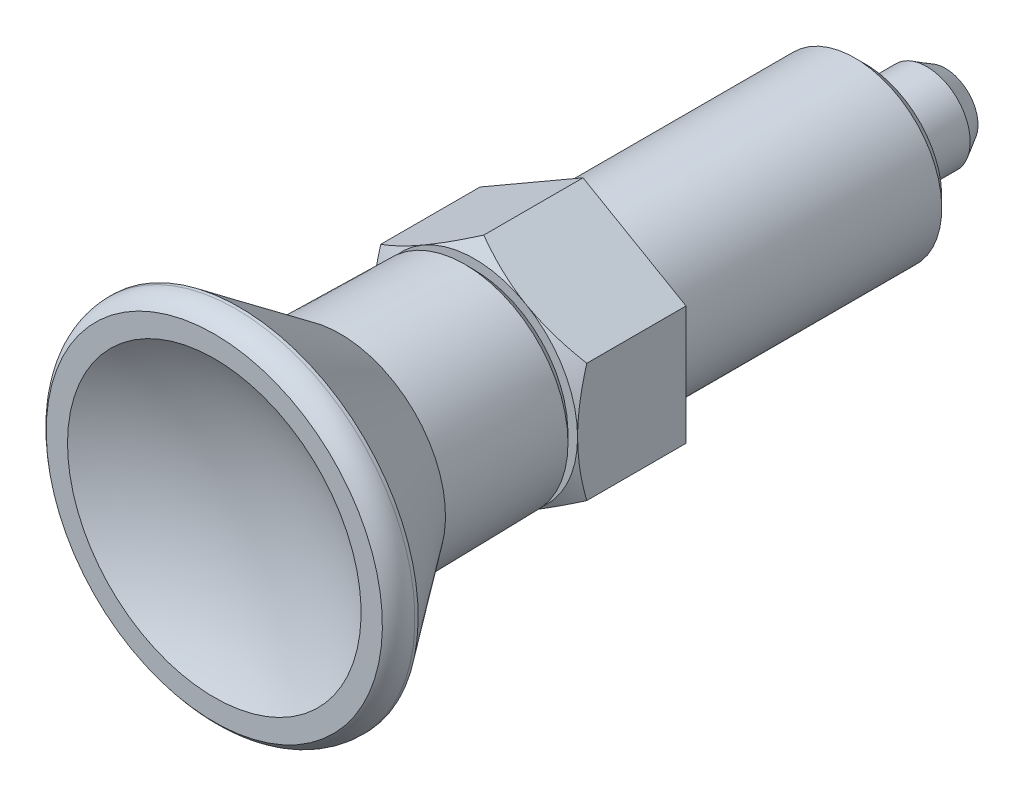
ISO-10303-21;
HEADER;
FILE_DESCRIPTION(('STEP AP214'),'2;1');
FILE_NAME('part.step','',(''),(''),'','','');
FILE_SCHEMA(('AUTOMOTIVE_DESIGN { 1 0 10303 214 1 1 1 1 }'));
ENDSEC;
DATA;
#1=APPLICATION_CONTEXT('core data for automotive mechanical design processes');
#2=APPLICATION_PROTOCOL_DEFINITION('international standard','automotive_design',2000,#1);
#3=PRODUCT_CONTEXT('',#1,'mechanical');
#4=PRODUCT('Part','Part','',(#3));
#5=PRODUCT_RELATED_PRODUCT_CATEGORY('part','',(#4));
#6=PRODUCT_DEFINITION_FORMATION('','',#4);
#7=PRODUCT_DEFINITION_CONTEXT('part definition',#1,'design');
#8=PRODUCT_DEFINITION('design','',#6,#7);
#9=PRODUCT_DEFINITION_SHAPE('','',#8);
#10=(LENGTH_UNIT() NAMED_UNIT(*) SI_UNIT(.MILLI.,.METRE.));
#11=(NAMED_UNIT(*) PLANE_ANGLE_UNIT() SI_UNIT($,.RADIAN.));
#12=(NAMED_UNIT(*) SI_UNIT($,.STERADIAN.) SOLID_ANGLE_UNIT());
#13=UNCERTAINTY_MEASURE_WITH_UNIT(LENGTH_MEASURE(1.E-05),#10,'distance_accuracy_value','');
#14=(GEOMETRIC_REPRESENTATION_CONTEXT(3) GLOBAL_UNCERTAINTY_ASSIGNED_CONTEXT((#13)) GLOBAL_UNIT_ASSIGNED_CONTEXT((#10,
#11,#12)) REPRESENTATION_CONTEXT('',''));
#15=CARTESIAN_POINT('',(0.,0.,0.));
#16=DIRECTION('',(0.,0.,1.));
#17=DIRECTION('',(1.,0.,0.));
#18=AXIS2_PLACEMENT_3D('',#15,#16,#17);
#19=CARTESIAN_POINT('',(0.,0.,-26.));
#20=DIRECTION('',(-1.,0.,0.));
#21=DIRECTION('',(0.,1.,0.));
#22=AXIS2_PLACEMENT_3D('',#19,#20,#21);
#23=SPHERICAL_SURFACE('',#22,8.00000000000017);
#24=CARTESIAN_POINT('',(0.,0.,-33.4113534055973));
#25=DIRECTION('',(0.,0.,1.));
#26=DIRECTION('',(0.,-1.,0.));
#27=AXIS2_PLACEMENT_3D('',#24,#25,#26);
#28=CIRCLE('',#27,3.0119496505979);
#29=CARTESIAN_POINT('',(0.,-3.0119496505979,-33.4113534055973));
#30=VERTEX_POINT('',#29);
#31=EDGE_CURVE('E18',#30,#30,#28,.T.);
#32=ORIENTED_EDGE('',*,*,#31,.F.);
#33=EDGE_LOOP('',(#32));
#34=FACE_BOUND('',#33,.T.);
#35=ADVANCED_FACE('F14',(#34),#23,.T.);
#36=CARTESIAN_POINT('',(0.,0.,-31.7000000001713));
#37=DIRECTION('',(0.,0.,1.));
#38=DIRECTION('',(0.,-1.,0.));
#39=AXIS2_PLACEMENT_3D('',#36,#37,#38);
#40=CONICAL_SURFACE('',#39,3.99999999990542,0.523598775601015);
#41=CARTESIAN_POINT('',(0.,0.,-31.7));
#42=DIRECTION('',(0.,0.,1.));
#43=DIRECTION('',(0.,-1.,0.));
#44=AXIS2_PLACEMENT_3D('',#41,#42,#43);
#45=CIRCLE('',#44,4.);
#46=CARTESIAN_POINT('',(0.,-4.,-31.7));
#47=VERTEX_POINT('',#46);
#48=EDGE_CURVE('E190',#47,#47,#45,.T.);
#49=ORIENTED_EDGE('',*,*,#48,.F.);
#50=EDGE_LOOP('',(#49));
#51=FACE_BOUND('',#50,.T.);
#52=ORIENTED_EDGE('',*,*,#31,.T.);
#53=EDGE_LOOP('',(#52));
#54=FACE_BOUND('',#53,.T.);
#55=ADVANCED_FACE('F297',(#51,#54),#40,.T.);
#56=CARTESIAN_POINT('',(0.,0.,-34.));
#57=DIRECTION('',(0.,0.,1.));
#58=DIRECTION('',(0.,-1.,0.));
#59=AXIS2_PLACEMENT_3D('',#56,#57,#58);
#60=CYLINDRICAL_SURFACE('',#59,4.);
#61=CARTESIAN_POINT('',(0.,0.,-26.4999999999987));
#62=DIRECTION('',(0.,0.,-1.));
#63=DIRECTION('',(0.,1.,0.));
#64=AXIS2_PLACEMENT_3D('',#61,#62,#63);
#65=CIRCLE('',#64,3.99999999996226);
#66=CARTESIAN_POINT('',(0.,3.99999999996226,-26.4999999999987));
#67=VERTEX_POINT('',#66);
#68=EDGE_CURVE('E185',#67,#67,#65,.F.);
#69=ORIENTED_EDGE('',*,*,#68,.F.);
#70=EDGE_LOOP('',(#69));
#71=FACE_BOUND('',#70,.T.);
#72=ORIENTED_EDGE('',*,*,#48,.T.);
#73=EDGE_LOOP('',(#72));
#74=FACE_BOUND('',#73,.T.);
#75=ADVANCED_FACE('F292',(#71,#74),#60,.T.);
#76=CARTESIAN_POINT('',(0.,0.,-26.4999999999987));
#77=DIRECTION('',(0.,0.,-1.));
#78=DIRECTION('',(1.,0.,0.));
#79=AXIS2_PLACEMENT_3D('',#76,#77,#78);
#80=CONICAL_SURFACE('',#79,3.99999999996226,0.523598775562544);
#81=CARTESIAN_POINT('',(0.,0.,-26.3267949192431));
#82=DIRECTION('',(0.,0.,1.));
#83=DIRECTION('',(0.,-1.,0.));
#84=AXIS2_PLACEMENT_3D('',#81,#82,#83);
#85=CIRCLE('',#84,3.9);
#86=CARTESIAN_POINT('',(0.,-3.9,-26.3267949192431));
#87=VERTEX_POINT('',#86);
#88=EDGE_CURVE('E176',#87,#87,#85,.T.);
#89=ORIENTED_EDGE('',*,*,#88,.F.);
#90=EDGE_LOOP('',(#89));
#91=FACE_BOUND('',#90,.T.);
#92=ORIENTED_EDGE('',*,*,#68,.T.);
#93=EDGE_LOOP('',(#92));
#94=FACE_BOUND('',#93,.T.);
#95=ADVANCED_FACE('F287',(#91,#94),#80,.T.);
#96=CARTESIAN_POINT('',(0.,0.,-34.));
#97=DIRECTION('',(0.,0.,1.));
#98=DIRECTION('',(0.,-1.,0.));
#99=AXIS2_PLACEMENT_3D('',#96,#97,#98);
#100=CYLINDRICAL_SURFACE('',#99,3.9);
#101=CARTESIAN_POINT('',(0.,0.,-26.2));
#102=DIRECTION('',(0.,0.,-1.));
#103=DIRECTION('',(0.,1.,0.));
#104=AXIS2_PLACEMENT_3D('',#101,#102,#103);
#105=CIRCLE('',#104,3.9);
#106=CARTESIAN_POINT('',(0.,3.9,-26.2));
#107=VERTEX_POINT('',#106);
#108=EDGE_CURVE('E184',#107,#107,#105,.T.);
#109=ORIENTED_EDGE('',*,*,#108,.T.);
#110=EDGE_LOOP('',(#109));
#111=FACE_BOUND('',#110,.T.);
#112=ORIENTED_EDGE('',*,*,#88,.T.);
#113=EDGE_LOOP('',(#112));
#114=FACE_BOUND('',#113,.T.);
#115=ADVANCED_FACE('F167',(#111,#114),#100,.T.);
#116=CARTESIAN_POINT('',(0.,0.,-26.2));
#117=DIRECTION('',(0.,0.,-1.));
#118=DIRECTION('',(0.,1.,0.));
#119=AXIS2_PLACEMENT_3D('',#116,#117,#118);
#120=TOROIDAL_SURFACE('',#119,4.1,0.200000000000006);
#121=CARTESIAN_POINT('',(0.,0.,-26.));
#122=DIRECTION('',(0.,0.,-1.));
#123=DIRECTION('',(0.,1.,0.));
#124=AXIS2_PLACEMENT_3D('',#121,#122,#123);
#125=CIRCLE('',#124,4.1);
#126=CARTESIAN_POINT('',(0.,4.1,-26.));
#127=VERTEX_POINT('',#126);
#128=EDGE_CURVE('E143',#127,#127,#125,.T.);
#129=ORIENTED_EDGE('',*,*,#128,.T.);
#130=EDGE_LOOP('',(#129));
#131=FACE_BOUND('',#130,.T.);
#132=ORIENTED_EDGE('',*,*,#108,.F.);
#133=EDGE_LOOP('',(#132));
#134=FACE_BOUND('',#133,.T.);
#135=ADVANCED_FACE('F161',(#131,#134),#120,.F.);
#136=CARTESIAN_POINT('',(5.32679491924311,0.,-26.));
#137=DIRECTION('',(0.,0.,1.));
#138=DIRECTION('',(0.,-1.,0.));
#139=AXIS2_PLACEMENT_3D('',#136,#137,#138);
#140=PLANE('',#139);
#141=CARTESIAN_POINT('',(0.,0.,-26.0000000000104));
#142=DIRECTION('',(0.,0.,1.));
#143=DIRECTION('',(-1.,0.,0.));
#144=AXIS2_PLACEMENT_3D('',#141,#142,#143);
#145=CIRCLE('',#144,5.32679491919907);
#146=CARTESIAN_POINT('',(-5.32679491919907,0.,-26.0000000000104));
#147=VERTEX_POINT('',#146);
#148=EDGE_CURVE('E136',#147,#147,#145,.T.);
#149=ORIENTED_EDGE('',*,*,#148,.F.);
#150=EDGE_LOOP('',(#149));
#151=FACE_BOUND('',#150,.T.);
#152=ORIENTED_EDGE('',*,*,#128,.F.);
#153=EDGE_LOOP('',(#152));
#154=FACE_BOUND('',#153,.T.);
#155=ADVANCED_FACE('F150',(#151,#154),#140,.F.);
#156=CARTESIAN_POINT('',(0.,0.,-25.6999999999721));
#157=DIRECTION('',(0.,0.,1.));
#158=DIRECTION('',(-1.,0.,0.));
#159=AXIS2_PLACEMENT_3D('',#156,#157,#158);
#160=CONICAL_SURFACE('',#159,5.49999999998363,0.52359877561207);
#161=CARTESIAN_POINT('',(0.,0.,-25.7));
#162=DIRECTION('',(0.,0.,1.));
#163=DIRECTION('',(0.,-1.,0.));
#164=AXIS2_PLACEMENT_3D('',#161,#162,#163);
#165=CIRCLE('',#164,5.5);
#166=CARTESIAN_POINT('',(0.,-5.5,-25.7));
#167=VERTEX_POINT('',#166);
#168=EDGE_CURVE('E132',#167,#167,#165,.F.);
#169=ORIENTED_EDGE('',*,*,#168,.T.);
#170=EDGE_LOOP('',(#169));
#171=FACE_BOUND('',#170,.T.);
#172=ORIENTED_EDGE('',*,*,#148,.T.);
#173=EDGE_LOOP('',(#172));
#174=FACE_BOUND('',#173,.T.);
#175=ADVANCED_FACE('F160',(#171,#174),#160,.T.);
#176=CARTESIAN_POINT('',(0.,0.,-26.));
#177=DIRECTION('',(0.,0.,1.));
#178=DIRECTION('',(0.,-1.,0.));
#179=AXIS2_PLACEMENT_3D('',#176,#177,#178);
#180=CYLINDRICAL_SURFACE('',#179,5.5);
#181=ORIENTED_EDGE('',*,*,#168,.F.);
#182=EDGE_LOOP('',(#181));
#183=FACE_BOUND('',#182,.T.);
#184=CARTESIAN_POINT('',(0.,0.,-26.));
#185=DIRECTION('',(0.,0.,1.));
#186=DIRECTION('',(0.,-1.,0.));
#187=AXIS2_PLACEMENT_3D('',#184,#185,#186);
#188=CIRCLE('',#187,5.5);
#189=CARTESIAN_POINT('',(0.,-5.5,-26.));
#190=VERTEX_POINT('',#189);
#191=EDGE_CURVE('E135',#190,#190,#188,.T.);
#192=ORIENTED_EDGE('',*,*,#191,.F.);
#193=EDGE_LOOP('',(#192));
#194=FACE_BOUND('',#193,.T.);
#195=ADVANCED_FACE('F255',(#183,#194),#180,.F.);
#196=CARTESIAN_POINT('',(5.5,0.,-26.));
#197=DIRECTION('',(0.,0.,-1.));
#198=DIRECTION('',(0.,1.,0.));
#199=AXIS2_PLACEMENT_3D('',#196,#197,#198);
#200=PLANE('',#199);
#201=ORIENTED_EDGE('',*,*,#191,.T.);
#202=EDGE_LOOP('',(#201));
#203=FACE_BOUND('',#202,.T.);
#204=CARTESIAN_POINT('',(0.,0.,-26.));
#205=DIRECTION('',(0.,0.,1.));
#206=DIRECTION('',(0.,-1.,0.));
#207=AXIS2_PLACEMENT_3D('',#204,#205,#206);
#208=CIRCLE('',#207,7.08);
#209=CARTESIAN_POINT('',(0.,-7.08,-26.));
#210=VERTEX_POINT('',#209);
#211=EDGE_CURVE('E129',#210,#210,#208,.T.);
#212=ORIENTED_EDGE('',*,*,#211,.F.);
#213=EDGE_LOOP('',(#212));
#214=FACE_BOUND('',#213,.T.);
#215=ADVANCED_FACE('F246',(#203,#214),#200,.T.);
#216=CARTESIAN_POINT('',(0.,0.,-25.08));
#217=DIRECTION('',(0.,0.,1.));
#218=DIRECTION('',(0.,-1.,0.));
#219=AXIS2_PLACEMENT_3D('',#216,#217,#218);
#220=CONICAL_SURFACE('',#219,8.,0.785398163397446);
#221=ORIENTED_EDGE('',*,*,#211,.T.);
#222=EDGE_LOOP('',(#221));
#223=FACE_BOUND('',#222,.T.);
#224=CARTESIAN_POINT('',(0.,0.,-25.08));
#225=DIRECTION('',(0.,0.,1.));
#226=DIRECTION('',(0.,-1.,0.));
#227=AXIS2_PLACEMENT_3D('',#224,#225,#226);
#228=CIRCLE('',#227,8.);
#229=CARTESIAN_POINT('',(0.,-8.,-25.08));
#230=VERTEX_POINT('',#229);
#231=EDGE_CURVE('E126',#230,#230,#228,.T.);
#232=ORIENTED_EDGE('',*,*,#231,.F.);
#233=EDGE_LOOP('',(#232));
#234=FACE_BOUND('',#233,.T.);
#235=ADVANCED_FACE('F244',(#223,#234),#220,.T.);
#236=CARTESIAN_POINT('',(0.,0.,56.2));
#237=DIRECTION('',(-1.,0.,0.));
#238=DIRECTION('',(0.,1.,0.));
#239=AXIS2_PLACEMENT_3D('',#236,#237,#238);
#240=SPHERICAL_SURFACE('',#239,26.);
#241=CARTESIAN_POINT('',(0.,13.5336617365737,34.));
#242=CARTESIAN_POINT('',(-0.380232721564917,13.5336644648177,34.));
#243=CARTESIAN_POINT('',(-0.76042067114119,13.5176310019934,34.));
#244=CARTESIAN_POINT('',(-1.51822116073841,13.4536090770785,34.));
#245=CARTESIAN_POINT('',(-1.89583299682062,13.4056122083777,34.));
#246=CARTESIAN_POINT('',(-2.64607170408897,13.2779239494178,34.));
#247=CARTESIAN_POINT('',(-3.01869277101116,13.1981984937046,34.));
#248=CARTESIAN_POINT('',(-3.75588877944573,13.0076223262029,34.));
#249=CARTESIAN_POINT('',(-4.12046375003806,12.8967717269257,34.));
#250=CARTESIAN_POINT('',(-4.83879771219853,12.6447950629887,34.));
#251=CARTESIAN_POINT('',(-5.19256185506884,12.5036836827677,34.));
#252=CARTESIAN_POINT('',(-5.88694906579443,12.1921547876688,34.));
#253=CARTESIAN_POINT('',(-6.22757192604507,12.0217368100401,34.));
#254=CARTESIAN_POINT('',(-6.8931632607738,11.6528552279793,34.));
#255=CARTESIAN_POINT('',(-7.21813570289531,11.4543987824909,34.));
#256=CARTESIAN_POINT('',(-7.85020809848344,11.030818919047,34.));
#257=CARTESIAN_POINT('',(-8.15730812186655,10.8056956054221,34.));
#258=CARTESIAN_POINT('',(-8.75148587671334,10.3303561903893,34.));
#259=CARTESIAN_POINT('',(-9.0385614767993,10.080137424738,34.));
#260=CARTESIAN_POINT('',(-9.59061394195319,9.55640563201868,34.));
#261=CARTESIAN_POINT('',(-9.85559078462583,9.2828925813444,34.));
#262=CARTESIAN_POINT('',(-10.3615715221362,8.71450579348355,34.));
#263=CARTESIAN_POINT('',(-10.6025744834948,8.41963122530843,34.));
#264=CARTESIAN_POINT('',(-11.0588822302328,7.81062733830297,34.));
#265=CARTESIAN_POINT('',(-11.2741870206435,7.49649802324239,34.));
#266=CARTESIAN_POINT('',(-11.6775639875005,6.85122394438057,34.));
#267=CARTESIAN_POINT('',(-11.8656366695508,6.52007949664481,34.));
#268=CARTESIAN_POINT('',(-12.2132170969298,5.84312402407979,34.));
#269=CARTESIAN_POINT('',(-12.3727248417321,5.49731299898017,34.));
#270=CARTESIAN_POINT('',(-12.6620410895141,4.7934836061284,34.));
#271=CARTESIAN_POINT('',(-12.7918496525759,4.43546526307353,34.));
#272=CARTESIAN_POINT('',(-13.0208450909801,3.70976586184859,34.));
#273=CARTESIAN_POINT('',(-13.120031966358,3.34208480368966,34.));
#274=CARTESIAN_POINT('',(-13.287079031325,2.59967324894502,34.));
#275=CARTESIAN_POINT('',(-13.3549391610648,2.22494273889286,34.));
#276=CARTESIAN_POINT('',(-13.4588500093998,1.47109707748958,34.));
#277=CARTESIAN_POINT('',(-13.4949007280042,1.09198192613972,34.));
#278=CARTESIAN_POINT('',(-13.534936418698,0.332062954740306,34.));
#279=CARTESIAN_POINT('',(-13.5389214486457,-0.048740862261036,34.));
#280=CARTESIAN_POINT('',(-13.514797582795,-0.809330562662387,34.));
#281=CARTESIAN_POINT('',(-13.4866886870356,-1.18911644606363,34.));
#282=CARTESIAN_POINT('',(-13.3985767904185,-1.94497037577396,34.));
#283=CARTESIAN_POINT('',(-13.3385737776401,-2.32103842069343,34.));
#284=CARTESIAN_POINT('',(-13.1871002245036,-3.06678291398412,34.));
#285=CARTESIAN_POINT('',(-13.0956296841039,-3.43645936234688,34.));
#286=CARTESIAN_POINT('',(-12.8818712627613,-4.16679287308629,34.));
#287=CARTESIAN_POINT('',(-12.7595833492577,-4.52744992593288,34.));
#288=CARTESIAN_POINT('',(-12.4850596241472,-5.23718018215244,34.));
#289=CARTESIAN_POINT('',(-12.3328238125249,-5.58625338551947,34.));
#290=CARTESIAN_POINT('',(-11.999486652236,-6.27033412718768,34.));
#291=CARTESIAN_POINT('',(-11.8183853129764,-6.60534167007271,34.));
#292=CARTESIAN_POINT('',(-11.4286045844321,-7.25890950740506,34.));
#293=CARTESIAN_POINT('',(-11.2199251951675,-7.57746980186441,34.));
#294=CARTESIAN_POINT('',(-10.7764720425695,-8.19587824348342,34.));
#295=CARTESIAN_POINT('',(-10.5416982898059,-8.49572639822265,34.));
#296=CARTESIAN_POINT('',(-10.0477254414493,-9.07457896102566,34.));
#297=CARTESIAN_POINT('',(-9.78852634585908,-9.35358336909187,34.));
#298=CARTESIAN_POINT('',(-9.24754552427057,-9.88876492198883,34.));
#299=CARTESIAN_POINT('',(-8.96576379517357,-10.1449420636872,34.));
#300=CARTESIAN_POINT('',(-8.38162103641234,-10.6326477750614,34.));
#301=CARTESIAN_POINT('',(-8.07926000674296,-10.864176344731,34.));
#302=CARTESIAN_POINT('',(-7.45610821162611,-11.3009389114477,34.));
#303=CARTESIAN_POINT('',(-7.13531744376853,-11.5061729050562,34.));
#304=CARTESIAN_POINT('',(-6.47758683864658,-11.8888871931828,34.));
#305=CARTESIAN_POINT('',(-6.14064700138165,-12.0663674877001,34.));
#306=CARTESIAN_POINT('',(-5.45301371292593,-12.3923125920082,34.));
#307=CARTESIAN_POINT('',(-5.10232026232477,-12.5407774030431,34.));
#308=CARTESIAN_POINT('',(-4.38967295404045,-12.8076360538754,34.));
#309=CARTESIAN_POINT('',(-4.02771909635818,-12.9260298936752,34.));
#310=CARTESIAN_POINT('',(-3.2951242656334,-13.1319048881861,34.));
#311=CARTESIAN_POINT('',(-2.9244832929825,-13.2193860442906,34.));
#312=CARTESIAN_POINT('',(-2.17714925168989,-13.3628137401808,34.));
#313=CARTESIAN_POINT('',(-1.80045618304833,-13.4187602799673,34.));
#314=CARTESIAN_POINT('',(-1.04369601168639,-13.4987209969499,34.));
#315=CARTESIAN_POINT('',(-0.663628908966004,-13.5227351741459,34.));
#316=CARTESIAN_POINT('',(0.0971772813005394,-13.538660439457,34.));
#317=CARTESIAN_POINT('',(0.477916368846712,-13.5305715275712,34.));
#318=CARTESIAN_POINT('',(1.2373597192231,-13.4823481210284,34.));
#319=CARTESIAN_POINT('',(1.61606398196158,-13.4422136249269,34.));
#320=CARTESIAN_POINT('',(2.36874530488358,-13.3301843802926,34.));
#321=CARTESIAN_POINT('',(2.74272236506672,-13.2582896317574,34.));
#322=CARTESIAN_POINT('',(3.48329054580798,-13.0832510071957,34.));
#323=CARTESIAN_POINT('',(3.84988166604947,-12.9801071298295,34.));
#324=CARTESIAN_POINT('',(4.57307170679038,-12.7433035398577,34.));
#325=CARTESIAN_POINT('',(4.92967062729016,-12.6096438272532,34.));
#326=CARTESIAN_POINT('',(5.63034101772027,-12.3127588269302,34.));
#327=CARTESIAN_POINT('',(5.97441248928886,-12.149533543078,34.));
#328=CARTESIAN_POINT('',(6.64758188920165,-11.7946778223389,34.));
#329=CARTESIAN_POINT('',(6.9766798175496,-11.6030473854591,34.));
#330=CARTESIAN_POINT('',(7.61756239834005,-11.1927437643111,34.));
#331=CARTESIAN_POINT('',(7.92934705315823,-10.9740705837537,34.));
#332=CARTESIAN_POINT('',(8.53338653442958,-10.5112360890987,34.));
#333=CARTESIAN_POINT('',(8.82564136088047,-10.2670747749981,34.));
#334=CARTESIAN_POINT('',(9.3885435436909,-9.75499974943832,34.));
#335=CARTESIAN_POINT('',(9.65919089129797,-9.48708602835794,34.));
#336=CARTESIAN_POINT('',(10.1769538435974,-8.92941097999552,34.));
#337=CARTESIAN_POINT('',(10.4240694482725,-8.6396496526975,34.));
#338=CARTESIAN_POINT('',(10.8930121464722,-8.04033932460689,34.));
#339=CARTESIAN_POINT('',(11.1148392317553,-7.73079031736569,34.));
#340=CARTESIAN_POINT('',(11.5316277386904,-7.09410542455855,34.));
#341=CARTESIAN_POINT('',(11.7265891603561,-6.76696953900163,34.));
#342=CARTESIAN_POINT('',(12.0882600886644,-6.09743698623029,34.));
#343=CARTESIAN_POINT('',(12.2549696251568,-5.75504033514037,34.));
#344=CARTESIAN_POINT('',(12.5589518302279,-5.05742016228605,34.));
#345=CARTESIAN_POINT('',(12.6962244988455,-4.70219664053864,34.));
#346=CARTESIAN_POINT('',(12.9403569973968,-3.98144828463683,34.));
#347=CARTESIAN_POINT('',(13.0472168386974,-3.61592345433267,34.));
#348=CARTESIAN_POINT('',(13.2297640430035,-2.87717101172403,34.));
#349=CARTESIAN_POINT('',(13.3054514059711,-2.50394339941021,34.));
#350=CARTESIAN_POINT('',(13.4251156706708,-1.75243813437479,34.));
#351=CARTESIAN_POINT('',(13.4690925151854,-1.37416047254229,34.));
#352=CARTESIAN_POINT('',(13.5250228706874,-0.615245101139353,34.));
#353=CARTESIAN_POINT('',(13.5369763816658,-0.234607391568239,34.));
#354=CARTESIAN_POINT('',(13.5287750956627,0.526321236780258,34.));
#355=CARTESIAN_POINT('',(13.5086203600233,0.906612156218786,34.));
#356=CARTESIAN_POINT('',(13.436345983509,1.6641442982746,34.));
#357=CARTESIAN_POINT('',(13.3842263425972,2.04138552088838,34.));
#358=CARTESIAN_POINT('',(13.2483925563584,2.79013707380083,34.));
#359=CARTESIAN_POINT('',(13.1646783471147,3.16164739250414,34.));
#360=CARTESIAN_POINT('',(12.9662505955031,3.89629512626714,34.));
#361=CARTESIAN_POINT('',(12.8515370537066,4.25943254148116,34.));
#362=CARTESIAN_POINT('',(12.5919237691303,4.9747594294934,34.));
#363=CARTESIAN_POINT('',(12.4470234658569,5.32694869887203,34.));
#364=CARTESIAN_POINT('',(12.1280681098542,6.01786835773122,34.));
#365=CARTESIAN_POINT('',(11.954013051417,6.35659874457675,34.));
#366=CARTESIAN_POINT('',(11.5779930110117,7.01817940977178,34.));
#367=CARTESIAN_POINT('',(11.3760291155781,7.34103030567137,34.));
#368=CARTESIAN_POINT('',(10.9456222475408,7.96857061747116,34.));
#369=CARTESIAN_POINT('',(10.7171793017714,8.27326005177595,34.));
#370=CARTESIAN_POINT('',(10.2354638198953,8.86228038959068,34.));
#371=CARTESIAN_POINT('',(9.98219392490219,9.14661345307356,34.));
#372=CARTESIAN_POINT('',(9.45260334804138,9.6929368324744,34.));
#373=CARTESIAN_POINT('',(9.17628257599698,9.95492706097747,34.));
#374=CARTESIAN_POINT('',(8.60248181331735,10.4547651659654,34.));
#375=CARTESIAN_POINT('',(8.30499644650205,10.6926068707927,34.));
#376=CARTESIAN_POINT('',(7.69104951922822,11.1423768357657,34.));
#377=CARTESIAN_POINT('',(7.37458825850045,11.3543055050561,34.));
#378=CARTESIAN_POINT('',(6.72477752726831,11.7508429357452,34.));
#379=CARTESIAN_POINT('',(6.39141995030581,11.9354384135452,34.));
#380=CARTESIAN_POINT('',(5.71033156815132,12.2758732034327,34.));
#381=CARTESIAN_POINT('',(5.36260071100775,12.4317124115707,34.));
#382=CARTESIAN_POINT('',(4.65561466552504,12.7133738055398,34.));
#383=CARTESIAN_POINT('',(4.29637227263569,12.8392280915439,34.));
#384=CARTESIAN_POINT('',(3.56868576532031,13.0602093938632,34.));
#385=CARTESIAN_POINT('',(3.20024409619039,13.1553444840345,34.));
#386=CARTESIAN_POINT('',(2.36403699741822,13.3340438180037,34.));
#387=CARTESIAN_POINT('',(1.89437148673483,13.4088370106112,34.));
#388=CARTESIAN_POINT('',(0.949780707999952,13.508644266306,34.));
#389=CARTESIAN_POINT('',(0.474855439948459,13.5336583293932,34.));
#390=CARTESIAN_POINT('',(0.,13.5336617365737,34.));
#391=B_SPLINE_CURVE_WITH_KNOTS('',3,(#241,#242,#243,#244,#245,#246,#247,#248,#249,#250,#251,
#252,#253,#254,#255,#256,#257,#258,#259,#260,#261,#262,#263,#264,#265,#266,#267,#268,#269,#270,
#271,#272,#273,#274,#275,#276,#277,#278,#279,#280,#281,#282,#283,#284,#285,#286,#287,#288,#289,
#290,#291,#292,#293,#294,#295,#296,#297,#298,#299,#300,#301,#302,#303,#304,#305,#306,#307,#308,
#309,#310,#311,#312,#313,#314,#315,#316,#317,#318,#319,#320,#321,#322,#323,#324,#325,#326,#327,
#328,#329,#330,#331,#332,#333,#334,#335,#336,#337,#338,#339,#340,#341,#342,#343,#344,#345,#346,
#347,#348,#349,#350,#351,#352,#353,#354,#355,#356,#357,#358,#359,#360,#361,#362,#363,#364,#365,
#366,#367,#368,#369,#370,#371,#372,#373,#374,#375,#376,#377,#378,#379,#380,#381,#382,#383,#384,
#385,#386,#387,#388,#389,#390),.UNSPECIFIED.,.T.,.F.,(4,2,2,2,2,2,2,2,2,2,2,2,2,2,2,2,2,2,2,2,2,
2,2,2,2,2,2,2,2,2,2,2,2,2,2,2,2,2,2,2,2,2,2,2,2,2,2,2,2,2,2,2,2,2,2,2,2,2,2,2,2,2,2,2,2,2,2,2,2,
2,2,2,2,2,4),(0.,1.14028337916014,2.28086677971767,3.42267808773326,4.56448526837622,
5.70573962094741,6.84701199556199,7.98799349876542,9.12897053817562,10.2700688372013,
11.4111682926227,12.5523121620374,13.693455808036,14.8345782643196,15.9757007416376,
17.1168209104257,18.257941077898,19.3990634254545,20.5401857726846,21.6813060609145,
22.82242634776,23.9635470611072,25.1046677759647,26.2457896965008,27.3869116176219,
28.5280331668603,29.6691547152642,30.8102758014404,31.9513968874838,33.0925181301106,
34.2336393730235,35.3747607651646,36.5158821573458,37.657003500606,38.798124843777,
39.9392461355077,41.0803674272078,42.2214887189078,43.3626100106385,44.5037313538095,
45.6448526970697,46.7859740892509,47.9270954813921,49.0682167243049,50.2093379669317,
51.3504590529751,52.4915801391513,53.6327016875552,54.7738232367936,55.9149451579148,
57.0560670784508,58.1971877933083,59.3383085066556,60.479428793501,61.620549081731,
62.761671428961,63.9027937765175,65.0439139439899,66.1850341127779,67.3261565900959,
68.4672790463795,69.6084226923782,70.7495665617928,71.8906660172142,73.0317643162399,
74.1727413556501,75.3137228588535,76.4549952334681,77.5962495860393,78.7380567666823,
79.8798680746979,81.0204514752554,82.1607348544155,83.5847831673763,85.0088314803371),.UNSPECIFIED.);
#392=CARTESIAN_POINT('',(0.,13.5336617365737,34.));
#393=VERTEX_POINT('',#392);
#394=EDGE_CURVE('E205',#393,#393,#391,.T.);
#395=ORIENTED_EDGE('',*,*,#394,.T.);
#396=EDGE_LOOP('',(#395));
#397=FACE_BOUND('',#396,.T.);
#398=ADVANCED_FACE('F215',(#397),#240,.F.);
#399=CARTESIAN_POINT('',(13.5336617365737,0.,34.));
#400=DIRECTION('',(0.,0.,-1.));
#401=DIRECTION('',(0.,1.,0.));
#402=AXIS2_PLACEMENT_3D('',#399,#400,#401);
#403=PLANE('',#402);
#404=ORIENTED_EDGE('',*,*,#394,.F.);
#405=EDGE_LOOP('',(#404));
#406=FACE_BOUND('',#405,.T.);
#407=CARTESIAN_POINT('',(0.,0.,34.));
#408=DIRECTION('',(0.,0.,-1.));
#409=DIRECTION('',(0.,1.,0.));
#410=AXIS2_PLACEMENT_3D('',#407,#408,#409);
#411=CIRCLE('',#410,15.5);
#412=CARTESIAN_POINT('',(0.,15.5,34.));
#413=VERTEX_POINT('',#412);
#414=EDGE_CURVE('E198',#413,#413,#411,.T.);
#415=ORIENTED_EDGE('',*,*,#414,.F.);
#416=EDGE_LOOP('',(#415));
#417=FACE_BOUND('',#416,.T.);
#418=ADVANCED_FACE('F220',(#406,#417),#403,.F.);
#419=CARTESIAN_POINT('',(0.,0.,32.));
#420=DIRECTION('',(0.,0.,-1.));
#421=DIRECTION('',(0.,1.,0.));
#422=AXIS2_PLACEMENT_3D('',#419,#420,#421);
#423=TOROIDAL_SURFACE('',#422,14.,2.5);
#424=CARTESIAN_POINT('',(0.,0.,32.));
#425=DIRECTION('',(0.,0.,1.));
#426=DIRECTION('',(0.,-1.,0.));
#427=AXIS2_PLACEMENT_3D('',#424,#425,#426);
#428=CIRCLE('',#427,16.5);
#429=CARTESIAN_POINT('',(0.,-16.5,32.));
#430=VERTEX_POINT('',#429);
#431=EDGE_CURVE('E662',#430,#430,#428,.F.);
#432=ORIENTED_EDGE('',*,*,#431,.F.);
#433=EDGE_LOOP('',(#432));
#434=FACE_BOUND('',#433,.T.);
#435=ORIENTED_EDGE('',*,*,#414,.T.);
#436=EDGE_LOOP('',(#435));
#437=FACE_BOUND('',#436,.T.);
#438=ADVANCED_FACE('F224',(#434,#437),#423,.T.);
#439=CARTESIAN_POINT('',(0.,0.,-34.));
#440=DIRECTION('',(0.,0.,1.));
#441=DIRECTION('',(0.,-1.,0.));
#442=AXIS2_PLACEMENT_3D('',#439,#440,#441);
#443=CYLINDRICAL_SURFACE('',#442,16.5);
#444=ORIENTED_EDGE('',*,*,#431,.T.);
#445=EDGE_LOOP('',(#444));
#446=FACE_BOUND('',#445,.T.);
#447=CARTESIAN_POINT('',(0.,0.,31.7));
#448=DIRECTION('',(0.,0.,1.));
#449=DIRECTION('',(0.,-1.,0.));
#450=AXIS2_PLACEMENT_3D('',#447,#448,#449);
#451=CIRCLE('',#450,16.5);
#452=CARTESIAN_POINT('',(0.,-16.5,31.7));
#453=VERTEX_POINT('',#452);
#454=EDGE_CURVE('E9',#453,#453,#451,.F.);
#455=ORIENTED_EDGE('',*,*,#454,.F.);
#456=EDGE_LOOP('',(#455));
#457=FACE_BOUND('',#456,.T.);
#458=ADVANCED_FACE('F403',(#446,#457),#443,.T.);
#459=CARTESIAN_POINT('',(0.,0.,31.7));
#460=DIRECTION('',(0.,0.,1.));
#461=DIRECTION('',(-1.,0.,0.));
#462=AXIS2_PLACEMENT_3D('',#459,#460,#461);
#463=CONICAL_SURFACE('',#462,16.5,0.630063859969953);
#464=ORIENTED_EDGE('',*,*,#454,.T.);
#465=EDGE_LOOP('',(#464));
#466=FACE_BOUND('',#465,.T.);
#467=CARTESIAN_POINT('',(0.,0.,22.3973578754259));
#468=DIRECTION('',(0.,0.,1.));
#469=DIRECTION('',(0.,-1.,0.));
#470=AXIS2_PLACEMENT_3D('',#467,#468,#469);
#471=CIRCLE('',#470,9.7163966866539);
#472=CARTESIAN_POINT('',(0.,-9.7163966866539,22.3973578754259));
#473=VERTEX_POINT('',#472);
#474=EDGE_CURVE('E24',#473,#473,#471,.T.);
#475=ORIENTED_EDGE('',*,*,#474,.T.);
#476=EDGE_LOOP('',(#475));
#477=FACE_BOUND('',#476,.T.);
#478=ADVANCED_FACE('F410',(#466,#477),#463,.T.);
#479=CARTESIAN_POINT('',(0.,0.,22.3973578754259));
#480=DIRECTION('',(0.,0.,1.));
#481=DIRECTION('',(0.,-1.,0.));
#482=AXIS2_PLACEMENT_3D('',#479,#480,#481);
#483=CONICAL_SURFACE('',#482,9.71639668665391,0.0174532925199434);
#484=ORIENTED_EDGE('',*,*,#474,.F.);
#485=EDGE_LOOP('',(#484));
#486=FACE_BOUND('',#485,.T.);
#487=CARTESIAN_POINT('',(0.,0.,10.8998629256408));
#488=DIRECTION('',(0.,0.,1.));
#489=DIRECTION('',(0.,-1.,0.));
#490=AXIS2_PLACEMENT_3D('',#487,#488,#489);
#491=CIRCLE('',#490,9.51570716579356);
#492=CARTESIAN_POINT('',(0.,-9.51570716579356,10.8998629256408));
#493=VERTEX_POINT('',#492);
#494=EDGE_CURVE('E201',#493,#493,#491,.T.);
#495=ORIENTED_EDGE('',*,*,#494,.T.);
#496=EDGE_LOOP('',(#495));
#497=FACE_BOUND('',#496,.T.);
#498=ADVANCED_FACE('F240',(#486,#497),#483,.T.);
#499=CARTESIAN_POINT('',(0.,0.,10.8998629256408));
#500=DIRECTION('',(0.,0.,1.));
#501=DIRECTION('',(0.,-1.,0.));
#502=AXIS2_PLACEMENT_3D('',#499,#500,#501);
#503=CONICAL_SURFACE('',#502,9.51570716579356,0.79412480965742);
#504=ORIENTED_EDGE('',*,*,#494,.F.);
#505=EDGE_LOOP('',(#504));
#506=FACE_BOUND('',#505,.T.);
#507=CARTESIAN_POINT('',(0.,0.,10.));
#508=DIRECTION('',(0.,0.,1.));
#509=DIRECTION('',(0.,-1.,0.));
#510=AXIS2_PLACEMENT_3D('',#507,#508,#509);
#511=CIRCLE('',#510,8.6);
#512=CARTESIAN_POINT('',(0.,-8.6,10.));
#513=VERTEX_POINT('',#512);
#514=EDGE_CURVE('E202',#513,#513,#511,.T.);
#515=ORIENTED_EDGE('',*,*,#514,.T.);
#516=EDGE_LOOP('',(#515));
#517=FACE_BOUND('',#516,.T.);
#518=ADVANCED_FACE('F226',(#506,#517),#503,.T.);
#519=CARTESIAN_POINT('',(9.5,0.,10.));
#520=DIRECTION('',(0.,0.,1.));
#521=DIRECTION('',(0.,-1.,0.));
#522=AXIS2_PLACEMENT_3D('',#519,#520,#521);
#523=PLANE('',#522);
#524=CARTESIAN_POINT('',(0.,0.,10.));
#525=DIRECTION('',(0.,0.,-1.));
#526=DIRECTION('',(0.,1.,0.));
#527=AXIS2_PLACEMENT_3D('',#524,#525,#526);
#528=CIRCLE('',#527,9.5);
#529=CARTESIAN_POINT('',(-9.5,0.,10.));
#530=VERTEX_POINT('',#529);
#531=CARTESIAN_POINT('',(-4.75,-8.22724133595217,10.));
#532=VERTEX_POINT('',#531);
#533=EDGE_CURVE('E690',#530,#532,#528,.F.);
#534=ORIENTED_EDGE('',*,*,#533,.T.);
#535=CARTESIAN_POINT('',(0.,0.,10.));
#536=DIRECTION('',(0.,0.,-1.));
#537=DIRECTION('',(0.,1.,0.));
#538=AXIS2_PLACEMENT_3D('',#535,#536,#537);
#539=CIRCLE('',#538,9.5);
#540=CARTESIAN_POINT('',(4.75,-8.22724133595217,10.));
#541=VERTEX_POINT('',#540);
#542=EDGE_CURVE('E213',#532,#541,#539,.F.);
#543=ORIENTED_EDGE('',*,*,#542,.T.);
#544=CARTESIAN_POINT('',(0.,0.,10.));
#545=DIRECTION('',(0.,0.,-1.));
#546=DIRECTION('',(0.,1.,0.));
#547=AXIS2_PLACEMENT_3D('',#544,#545,#546);
#548=CIRCLE('',#547,9.5);
#549=CARTESIAN_POINT('',(9.5,0.,10.));
#550=VERTEX_POINT('',#549);
#551=EDGE_CURVE('E647',#541,#550,#548,.F.);
#552=ORIENTED_EDGE('',*,*,#551,.T.);
#553=CARTESIAN_POINT('',(0.,0.,10.));
#554=DIRECTION('',(0.,0.,-1.));
#555=DIRECTION('',(0.,1.,0.));
#556=AXIS2_PLACEMENT_3D('',#553,#554,#555);
#557=CIRCLE('',#556,9.5);
#558=CARTESIAN_POINT('',(4.75,8.22724133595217,10.));
#559=VERTEX_POINT('',#558);
#560=EDGE_CURVE('E700',#550,#559,#557,.F.);
#561=ORIENTED_EDGE('',*,*,#560,.T.);
#562=CARTESIAN_POINT('',(0.,0.,10.));
#563=DIRECTION('',(0.,0.,-1.));
#564=DIRECTION('',(0.,1.,0.));
#565=AXIS2_PLACEMENT_3D('',#562,#563,#564);
#566=CIRCLE('',#565,9.5);
#567=CARTESIAN_POINT('',(-4.75,8.22724133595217,10.));
#568=VERTEX_POINT('',#567);
#569=EDGE_CURVE('E698',#559,#568,#566,.F.);
#570=ORIENTED_EDGE('',*,*,#569,.T.);
#571=CARTESIAN_POINT('',(0.,0.,10.));
#572=DIRECTION('',(0.,0.,-1.));
#573=DIRECTION('',(0.,1.,0.));
#574=AXIS2_PLACEMENT_3D('',#571,#572,#573);
#575=CIRCLE('',#574,9.5);
#576=EDGE_CURVE('E694',#568,#530,#575,.F.);
#577=ORIENTED_EDGE('',*,*,#576,.T.);
#578=EDGE_LOOP('',(#534,#543,#552,#561,#570,#577));
#579=FACE_BOUND('',#578,.T.);
#580=ORIENTED_EDGE('',*,*,#514,.F.);
#581=EDGE_LOOP('',(#580));
#582=FACE_BOUND('',#581,.T.);
#583=ADVANCED_FACE('F228',(#579,#582),#523,.T.);
#584=CARTESIAN_POINT('',(0.,0.,9.14640318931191));
#585=DIRECTION('',(0.,0.,-1.));
#586=DIRECTION('',(0.,1.,0.));
#587=AXIS2_PLACEMENT_3D('',#584,#585,#586);
#588=CONICAL_SURFACE('',#587,10.9784730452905,1.0471975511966);
#589=ORIENTED_EDGE('',*,*,#542,.F.);
#590=CARTESIAN_POINT('',(-4.75,-8.22724133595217,10.));
#591=CARTESIAN_POINT('',(-4.54838914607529,-8.34364141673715,10.0000388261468));
#592=CARTESIAN_POINT('',(-4.34678800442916,-8.46003589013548,9.9950603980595));
#593=CARTESIAN_POINT('',(-3.94398156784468,-8.69259629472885,9.97535760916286));
#594=CARTESIAN_POINT('',(-3.74277620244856,-8.80876226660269,9.96063517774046));
#595=CARTESIAN_POINT('',(-3.342060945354,-9.04011532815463,9.9218299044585));
#596=CARTESIAN_POINT('',(-3.14254760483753,-9.15530440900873,9.89779418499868));
#597=CARTESIAN_POINT('',(-2.74447147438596,-9.38513377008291,9.84087935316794));
#598=CARTESIAN_POINT('',(-2.54590870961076,-9.49977403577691,9.80800000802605));
#599=CARTESIAN_POINT('',(-1.95246933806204,-9.84239641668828,9.69711226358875));
#600=CARTESIAN_POINT('',(-1.55931669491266,-10.0693832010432,9.60680031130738));
#601=CARTESIAN_POINT('',(-0.776392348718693,-10.5214047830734,9.39851784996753));
#602=CARTESIAN_POINT('',(-0.38664795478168,-10.7464238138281,9.2804092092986));
#603=CARTESIAN_POINT('',(2.31894844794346E-08,-10.9696551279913,9.15149421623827));
#604=B_SPLINE_CURVE_WITH_KNOTS('',3,(#590,#591,#592,#593,#594,#595,#596,#597,#598,#599,#600,
#601,#602,#603),.UNSPECIFIED.,.F.,.F.,(4,2,2,2,2,2,4),(0.,0.698329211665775,1.39652019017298,
2.09122371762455,2.78594553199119,4.17356830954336,5.56823796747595),.UNSPECIFIED.);
#605=CARTESIAN_POINT('',(3.75145742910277E-08,-10.9696550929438,9.15149423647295));
#606=VERTEX_POINT('',#605);
#607=EDGE_CURVE('E33',#532,#606,#604,.T.);
#608=ORIENTED_EDGE('',*,*,#607,.T.);
#609=CARTESIAN_POINT('',(7.50291416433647E-08,-10.9696550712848,9.15149424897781));
#610=CARTESIAN_POINT('',(0.386648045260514,-10.7464237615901,9.28040923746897));
#611=CARTESIAN_POINT('',(0.776392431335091,-10.5214047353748,9.398517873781));
#612=CARTESIAN_POINT('',(1.55931676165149,-10.0693831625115,9.60680032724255));
#613=CARTESIAN_POINT('',(1.9524693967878,-9.84239638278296,9.69711227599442));
#614=CARTESIAN_POINT('',(2.54590875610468,-9.49977400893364,9.80800001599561));
#615=CARTESIAN_POINT('',(2.7444715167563,-9.38513374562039,9.84087935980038));
#616=CARTESIAN_POINT('',(3.1425476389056,-9.15530438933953,9.89779418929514));
#617=CARTESIAN_POINT('',(3.34206097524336,-9.040115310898,9.92182990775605));
#618=CARTESIAN_POINT('',(3.74277622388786,-8.80876225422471,9.96063517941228));
#619=CARTESIAN_POINT('',(3.9439815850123,-8.69259628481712,9.97535761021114));
#620=CARTESIAN_POINT('',(4.34678801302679,-8.46003588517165,9.99506039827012));
#621=CARTESIAN_POINT('',(4.5483891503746,-8.34364141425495,10.0000388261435));
#622=CARTESIAN_POINT('',(4.75,-8.22724133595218,10.));
#623=B_SPLINE_CURVE_WITH_KNOTS('',3,(#609,#610,#611,#612,#613,#614,#615,#616,#617,#618,#619,
#620,#621,#622),.UNSPECIFIED.,.F.,.F.,(4,2,2,2,2,2,4),(0.,1.39466962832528,2.78229237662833,
3.47701417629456,4.17171768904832,4.86990865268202,5.56823784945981),.UNSPECIFIED.);
#624=EDGE_CURVE('E585',#606,#541,#623,.T.);
#625=ORIENTED_EDGE('',*,*,#624,.T.);
#626=EDGE_LOOP('',(#589,#608,#625));
#627=FACE_BOUND('',#626,.T.);
#628=ADVANCED_FACE('F230',(#627),#588,.T.);
#629=CARTESIAN_POINT('',(0.,0.,9.14640318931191));
#630=DIRECTION('',(0.,0.,-1.));
#631=DIRECTION('',(0.,1.,0.));
#632=AXIS2_PLACEMENT_3D('',#629,#630,#631);
#633=CONICAL_SURFACE('',#632,10.9784730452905,1.0471975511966);
#634=ORIENTED_EDGE('',*,*,#551,.F.);
#635=CARTESIAN_POINT('',(4.75,-8.22724133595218,10.));
#636=CARTESIAN_POINT('',(4.95161085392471,-8.11084125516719,10.0000388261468));
#637=CARTESIAN_POINT('',(5.15321199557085,-7.99444678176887,9.99506039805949));
#638=CARTESIAN_POINT('',(5.55601843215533,-7.7618863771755,9.97535760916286));
#639=CARTESIAN_POINT('',(5.75722379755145,-7.64572040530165,9.96063517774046));
#640=CARTESIAN_POINT('',(6.15793905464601,-7.41436734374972,9.92182990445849));
#641=CARTESIAN_POINT('',(6.35745239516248,-7.29917826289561,9.89779418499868));
#642=CARTESIAN_POINT('',(6.75552852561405,-7.06934890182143,9.84087935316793));
#643=CARTESIAN_POINT('',(6.95409129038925,-6.95470863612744,9.80800000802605));
#644=CARTESIAN_POINT('',(7.54753066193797,-6.61208625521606,9.69711226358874));
#645=CARTESIAN_POINT('',(7.94068330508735,-6.38509947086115,9.60680031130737));
#646=CARTESIAN_POINT('',(8.72360765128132,-5.93307788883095,9.39851784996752));
#647=CARTESIAN_POINT('',(9.11335204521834,-5.70805885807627,9.28040920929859));
#648=CARTESIAN_POINT('',(9.5000000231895,-5.48482754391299,9.15149421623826));
#649=B_SPLINE_CURVE_WITH_KNOTS('',3,(#635,#636,#637,#638,#639,#640,#641,#642,#643,#644,#645,
#646,#647,#648),.UNSPECIFIED.,.F.,.F.,(4,2,2,2,2,2,4),(0.,0.698329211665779,1.39652019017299,
2.09122371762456,2.7859455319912,4.17356830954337,5.56823796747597),.UNSPECIFIED.);
#650=CARTESIAN_POINT('',(9.5,-5.48482751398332,9.15149423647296));
#651=VERTEX_POINT('',#650);
#652=EDGE_CURVE('E558',#541,#651,#649,.T.);
#653=ORIENTED_EDGE('',*,*,#652,.T.);
#654=CARTESIAN_POINT('',(9.5,-5.48482747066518,9.15149424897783));
#655=CARTESIAN_POINT('',(9.5,-5.03836485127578,9.28040923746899));
#656=CARTESIAN_POINT('',(9.5,-4.58832679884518,9.39851787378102));
#657=CARTESIAN_POINT('',(9.5,-3.68428365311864,9.60680032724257));
#658=CARTESIAN_POINT('',(9.5,-3.23031009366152,9.69711227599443));
#659=CARTESIAN_POINT('',(9.5,-2.54506534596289,9.80800001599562));
#660=CARTESIAN_POINT('',(9.5,-2.31578481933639,9.84087935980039));
#661=CARTESIAN_POINT('',(9.5,-1.85612610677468,9.89779418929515));
#662=CARTESIAN_POINT('',(9.5,-1.62574794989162,9.92182990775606));
#663=CARTESIAN_POINT('',(9.5,-1.16304183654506,9.96063517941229));
#664=CARTESIAN_POINT('',(9.5,-0.930709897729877,9.97535761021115));
#665=CARTESIAN_POINT('',(9.5,-0.465589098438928,9.99506039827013));
#666=CARTESIAN_POINT('',(9.5,-0.232800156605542,10.0000388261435));
#667=CARTESIAN_POINT('',(9.5,0.,10.));
#668=B_SPLINE_CURVE_WITH_KNOTS('',3,(#654,#655,#656,#657,#658,#659,#660,#661,#662,#663,#664,
#665,#666,#667),.UNSPECIFIED.,.F.,.F.,(4,2,2,2,2,2,4),(0.,1.39466962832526,2.78229237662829,
3.47701417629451,4.17171768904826,4.86990865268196,5.56823784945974),.UNSPECIFIED.);
#669=EDGE_CURVE('E68',#651,#550,#668,.T.);
#670=ORIENTED_EDGE('',*,*,#669,.T.);
#671=EDGE_LOOP('',(#634,#653,#670));
#672=FACE_BOUND('',#671,.T.);
#673=ADVANCED_FACE('F238',(#672),#633,.T.);
#674=CARTESIAN_POINT('',(0.,0.,9.14640318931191));
#675=DIRECTION('',(0.,0.,-1.));
#676=DIRECTION('',(0.,1.,0.));
#677=AXIS2_PLACEMENT_3D('',#674,#675,#676);
#678=CONICAL_SURFACE('',#677,10.9784730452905,1.0471975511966);
#679=ORIENTED_EDGE('',*,*,#560,.F.);
#680=CARTESIAN_POINT('',(9.5,0.,10.));
#681=CARTESIAN_POINT('',(9.5,0.232800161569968,10.0000388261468));
#682=CARTESIAN_POINT('',(9.5,0.465589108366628,9.9950603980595));
#683=CARTESIAN_POINT('',(9.5,0.930709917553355,9.97535760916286));
#684=CARTESIAN_POINT('',(9.5,1.16304186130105,9.96063517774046));
#685=CARTESIAN_POINT('',(9.5,1.62574798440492,9.9218299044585));
#686=CARTESIAN_POINT('',(9.5,1.85612614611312,9.89779418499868));
#687=CARTESIAN_POINT('',(9.5,2.31578486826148,9.84087935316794));
#688=CARTESIAN_POINT('',(9.5,2.54506539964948,9.80800000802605));
#689=CARTESIAN_POINT('',(9.5,3.23031016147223,9.69711226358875));
#690=CARTESIAN_POINT('',(9.5,3.68428373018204,9.60680031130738));
#691=CARTESIAN_POINT('',(9.5,4.58832689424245,9.39851784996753));
#692=CARTESIAN_POINT('',(9.5,5.03836495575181,9.2804092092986));
#693=CARTESIAN_POINT('',(9.5,5.48482758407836,9.15149421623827));
#694=B_SPLINE_CURVE_WITH_KNOTS('',3,(#680,#681,#682,#683,#684,#685,#686,#687,#688,#689,#690,
#691,#692,#693),.UNSPECIFIED.,.F.,.F.,(4,2,2,2,2,2,4),(0.,0.698329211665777,1.39652019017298,
2.09122371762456,2.78594553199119,4.17356830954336,5.56823796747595),.UNSPECIFIED.);
#695=CARTESIAN_POINT('',(9.49999996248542,5.4848275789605,9.15149423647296));
#696=VERTEX_POINT('',#695);
#697=EDGE_CURVE('E633',#550,#696,#694,.T.);
#698=ORIENTED_EDGE('',*,*,#697,.T.);
#699=CARTESIAN_POINT('',(9.49999992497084,5.48482760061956,9.15149424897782));
#700=CARTESIAN_POINT('',(9.11335195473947,5.70805891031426,9.28040923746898));
#701=CARTESIAN_POINT('',(8.72360756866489,5.93307793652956,9.39851787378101));
#702=CARTESIAN_POINT('',(7.9406832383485,6.38509950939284,9.60680032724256));
#703=CARTESIAN_POINT('',(7.54753060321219,6.6120862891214,9.69711227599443));
#704=CARTESIAN_POINT('',(6.95409124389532,6.95470866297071,9.80800001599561));
#705=CARTESIAN_POINT('',(6.75552848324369,7.06934892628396,9.84087935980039));
#706=CARTESIAN_POINT('',(6.3574523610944,7.29917828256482,9.89779418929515));
#707=CARTESIAN_POINT('',(6.15793902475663,7.41436736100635,9.92182990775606));
#708=CARTESIAN_POINT('',(5.75722377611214,7.64572041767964,9.96063517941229));
#709=CARTESIAN_POINT('',(5.5560184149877,7.76188638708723,9.97535761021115));
#710=CARTESIAN_POINT('',(5.15321198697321,7.9944467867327,9.99506039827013));
#711=CARTESIAN_POINT('',(4.9516108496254,8.1108412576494,10.0000388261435));
#712=CARTESIAN_POINT('',(4.75,8.22724133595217,10.));
#713=B_SPLINE_CURVE_WITH_KNOTS('',3,(#699,#700,#701,#702,#703,#704,#705,#706,#707,#708,#709,
#710,#711,#712),.UNSPECIFIED.,.F.,.F.,(4,2,2,2,2,2,4),(0.,1.39466962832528,2.78229237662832,
3.47701417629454,4.1717176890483,4.869908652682,5.56823784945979),.UNSPECIFIED.);
#714=EDGE_CURVE('E110',#696,#559,#713,.T.);
#715=ORIENTED_EDGE('',*,*,#714,.T.);
#716=EDGE_LOOP('',(#679,#698,#715));
#717=FACE_BOUND('',#716,.T.);
#718=ADVANCED_FACE('F432',(#717),#678,.T.);
#719=CARTESIAN_POINT('',(0.,0.,9.14640318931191));
#720=DIRECTION('',(0.,0.,-1.));
#721=DIRECTION('',(0.,1.,0.));
#722=AXIS2_PLACEMENT_3D('',#719,#720,#721);
#723=CONICAL_SURFACE('',#722,10.9784730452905,1.0471975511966);
#724=ORIENTED_EDGE('',*,*,#569,.F.);
#725=CARTESIAN_POINT('',(4.75,8.22724133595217,10.));
#726=CARTESIAN_POINT('',(4.54838914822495,8.34364141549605,10.0000388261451));
#727=CARTESIAN_POINT('',(4.34678800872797,8.46003588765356,9.99506039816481));
#728=CARTESIAN_POINT('',(3.94398157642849,8.69259628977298,9.975357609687));
#729=CARTESIAN_POINT('',(3.7427762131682,8.8087622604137,9.96063517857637));
#730=CARTESIAN_POINT('',(3.34206096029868,9.04011531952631,9.92182990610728));
#731=CARTESIAN_POINT('',(3.14254762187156,9.15530439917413,9.89779418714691));
#732=CARTESIAN_POINT('',(2.74447149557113,9.38513375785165,9.84087935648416));
#733=CARTESIAN_POINT('',(2.54590873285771,9.49977402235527,9.80800001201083));
#734=CARTESIAN_POINT('',(1.95246936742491,9.84239639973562,9.69711226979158));
#735=CARTESIAN_POINT('',(1.55931672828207,10.0693831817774,9.60680031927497));
#736=CARTESIAN_POINT('',(0.776392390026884,10.5214047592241,9.39851786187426));
#737=CARTESIAN_POINT('',(0.38664800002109,10.7464237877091,9.28040922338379));
#738=CARTESIAN_POINT('',(2.59198248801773E-08,10.9696550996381,9.15149423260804));
#739=B_SPLINE_CURVE_WITH_KNOTS('',3,(#725,#726,#727,#728,#729,#730,#731,#732,#733,#734,#735,
#736,#737,#738),.UNSPECIFIED.,.F.,.F.,(4,2,2,2,2,2,4),(0.,0.698329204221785,1.39652017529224,
2.09122369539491,2.78594550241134,4.17356826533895,5.56823790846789),.UNSPECIFIED.);
#740=CARTESIAN_POINT('',(-1.15429468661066E-08,10.9696551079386,9.15149422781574));
#741=VERTEX_POINT('',#740);
#742=EDGE_CURVE('E615',#559,#741,#739,.T.);
#743=ORIENTED_EDGE('',*,*,#742,.T.);
#744=CARTESIAN_POINT('',(-1.65411922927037E-08,10.9696550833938,9.15149422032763));
#745=CARTESIAN_POINT('',(-0.386647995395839,10.7464237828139,9.28040921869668));
#746=CARTESIAN_POINT('',(-0.776392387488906,10.521404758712,9.39851786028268));
#747=CARTESIAN_POINT('',(-1.55931672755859,10.0693831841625,9.60680031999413));
#748=CARTESIAN_POINT('',(-1.95246936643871,9.84239640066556,9.69711226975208));
#749=CARTESIAN_POINT('',(-2.54590873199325,9.49977402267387,9.80800001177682));
#750=CARTESIAN_POINT('',(-2.74447149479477,9.38513375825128,9.84087935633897));
#751=CARTESIAN_POINT('',(-3.14254762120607,9.15530439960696,9.89779418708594));
#752=CARTESIAN_POINT('',(-3.34206095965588,9.04011531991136,9.92182990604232));
#753=CARTESIAN_POINT('',(-3.74277621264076,8.80876226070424,9.960635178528));
#754=CARTESIAN_POINT('',(-3.94398157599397,8.69259629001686,9.97535760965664));
#755=CARTESIAN_POINT('',(-4.34678800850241,8.46003588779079,9.99506039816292));
#756=CARTESIAN_POINT('',(-4.54838914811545,8.34364141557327,10.0000388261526));
#757=CARTESIAN_POINT('',(-4.75,8.22724133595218,10.));
#758=B_SPLINE_CURVE_WITH_KNOTS('',3,(#744,#745,#746,#747,#748,#749,#750,#751,#752,#753,#754,
#755,#756,#757),.UNSPECIFIED.,.F.,.F.,(4,2,2,2,2,2,4),(0.,1.39466964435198,2.78229240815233,
3.47701421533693,4.17171773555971,4.86990870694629,5.56823791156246),.UNSPECIFIED.);
#759=EDGE_CURVE('E626',#741,#568,#758,.T.);
#760=ORIENTED_EDGE('',*,*,#759,.T.);
#761=EDGE_LOOP('',(#724,#743,#760));
#762=FACE_BOUND('',#761,.T.);
#763=ADVANCED_FACE('F442',(#762),#723,.T.);
#764=CARTESIAN_POINT('',(0.,0.,9.14640318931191));
#765=DIRECTION('',(0.,0.,-1.));
#766=DIRECTION('',(0.,1.,0.));
#767=AXIS2_PLACEMENT_3D('',#764,#765,#766);
#768=CONICAL_SURFACE('',#767,10.9784730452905,1.0471975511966);
#769=CARTESIAN_POINT('',(-9.5000000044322,-5.48482751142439,9.15149419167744));
#770=CARTESIAN_POINT('',(-9.11335204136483,-5.70805884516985,9.28040919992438));
#771=CARTESIAN_POINT('',(-8.72360765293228,-5.93307788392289,9.39851784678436));
#772=CARTESIAN_POINT('',(-7.94068330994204,-6.38509947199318,9.6068003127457));
#773=CARTESIAN_POINT('',(-7.54753066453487,-6.61208625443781,9.69711226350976));
#774=CARTESIAN_POINT('',(-6.95409129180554,-6.95470863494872,9.80800000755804));
#775=CARTESIAN_POINT('',(-6.75552852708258,-7.06934890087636,9.84087935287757));
#776=CARTESIAN_POINT('',(-6.35745239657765,-7.29917826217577,9.89779418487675));
#777=CARTESIAN_POINT('',(-6.15793905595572,-7.41436734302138,9.92182990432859));
#778=CARTESIAN_POINT('',(-5.75722379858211,-7.64572040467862,9.96063517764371));
#779=CARTESIAN_POINT('',(-5.55601843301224,-7.76188637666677,9.97535760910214));
#780=CARTESIAN_POINT('',(-5.15321199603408,-7.9944467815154,9.99506039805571));
#781=CARTESIAN_POINT('',(-4.95161085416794,-8.11084125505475,10.0000388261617));
#782=CARTESIAN_POINT('',(-4.75,-8.22724133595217,10.));
#783=B_SPLINE_CURVE_WITH_KNOTS('',3,(#769,#770,#771,#772,#773,#774,#775,#776,#777,#778,#779,
#780,#781,#782),.UNSPECIFIED.,.F.,.F.,(4,2,2,2,2,2,4),(0.,1.39466966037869,2.78229243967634,
3.47701425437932,4.17171778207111,4.86990876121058,5.56823797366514),.UNSPECIFIED.);
#784=CARTESIAN_POINT('',(-9.50000001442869,-5.48482754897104,9.15149421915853));
#785=VERTEX_POINT('',#784);
#786=EDGE_CURVE('E579',#785,#532,#783,.T.);
#787=ORIENTED_EDGE('',*,*,#786,.T.);
#788=ORIENTED_EDGE('',*,*,#533,.F.);
#789=CARTESIAN_POINT('',(-9.5,0.,10.));
#790=CARTESIAN_POINT('',(-9.5,-0.232800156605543,10.0000388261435));
#791=CARTESIAN_POINT('',(-9.5,-0.46558909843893,9.99506039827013));
#792=CARTESIAN_POINT('',(-9.5,-0.930709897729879,9.97535761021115));
#793=CARTESIAN_POINT('',(-9.5,-1.16304183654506,9.96063517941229));
#794=CARTESIAN_POINT('',(-9.5,-1.62574794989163,9.92182990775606));
#795=CARTESIAN_POINT('',(-9.5,-1.85612610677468,9.89779418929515));
#796=CARTESIAN_POINT('',(-9.5,-2.31578481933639,9.84087935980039));
#797=CARTESIAN_POINT('',(-9.5,-2.54506534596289,9.80800001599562));
#798=CARTESIAN_POINT('',(-9.5,-3.23031009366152,9.69711227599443));
#799=CARTESIAN_POINT('',(-9.5,-3.68428365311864,9.60680032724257));
#800=CARTESIAN_POINT('',(-9.5,-4.58832679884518,9.39851787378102));
#801=CARTESIAN_POINT('',(-9.5,-5.03836485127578,9.28040923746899));
#802=CARTESIAN_POINT('',(-9.5,-5.48482747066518,9.15149424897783));
#803=B_SPLINE_CURVE_WITH_KNOTS('',3,(#789,#790,#791,#792,#793,#794,#795,#796,#797,#798,#799,
#800,#801,#802),.UNSPECIFIED.,.F.,.F.,(4,2,2,2,2,2,4),(0.,0.698329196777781,1.39652016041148,
2.09122367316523,2.78594547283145,4.17356822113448,5.56823784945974),.UNSPECIFIED.);
#804=EDGE_CURVE('E586',#530,#785,#803,.T.);
#805=ORIENTED_EDGE('',*,*,#804,.T.);
#806=EDGE_LOOP('',(#787,#788,#805));
#807=FACE_BOUND('',#806,.T.);
#808=ADVANCED_FACE('F452',(#807),#768,.T.);
#809=CARTESIAN_POINT('',(0.,0.,9.14640318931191));
#810=DIRECTION('',(0.,0.,-1.));
#811=DIRECTION('',(0.,1.,0.));
#812=AXIS2_PLACEMENT_3D('',#809,#810,#811);
#813=CONICAL_SURFACE('',#812,10.9784730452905,1.0471975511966);
#814=ORIENTED_EDGE('',*,*,#576,.F.);
#815=CARTESIAN_POINT('',(-4.75,8.22724133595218,10.));
#816=CARTESIAN_POINT('',(-4.95161085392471,8.11084125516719,10.0000388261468));
#817=CARTESIAN_POINT('',(-5.15321199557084,7.99444678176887,9.99506039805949));
#818=CARTESIAN_POINT('',(-5.55601843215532,7.76188637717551,9.97535760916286));
#819=CARTESIAN_POINT('',(-5.75722379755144,7.64572040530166,9.96063517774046));
#820=CARTESIAN_POINT('',(-6.157939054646,7.41436734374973,9.9218299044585));
#821=CARTESIAN_POINT('',(-6.35745239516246,7.29917826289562,9.89779418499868));
#822=CARTESIAN_POINT('',(-6.75552852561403,7.06934890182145,9.84087935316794));
#823=CARTESIAN_POINT('',(-6.95409129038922,6.95470863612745,9.80800000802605));
#824=CARTESIAN_POINT('',(-7.54753066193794,6.61208625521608,9.69711226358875));
#825=CARTESIAN_POINT('',(-7.94068330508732,6.38509947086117,9.60680031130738));
#826=CARTESIAN_POINT('',(-8.72360765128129,5.93307788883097,9.39851784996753));
#827=CARTESIAN_POINT('',(-9.1133520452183,5.70805885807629,9.28040920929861));
#828=CARTESIAN_POINT('',(-9.50000002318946,5.48482754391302,9.15149421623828));
#829=B_SPLINE_CURVE_WITH_KNOTS('',3,(#815,#816,#817,#818,#819,#820,#821,#822,#823,#824,#825,
#826,#827,#828),.UNSPECIFIED.,.F.,.F.,(4,2,2,2,2,2,4),(0.,0.698329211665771,1.39652019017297,
2.09122371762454,2.78594553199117,4.17356830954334,5.56823796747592),.UNSPECIFIED.);
#830=CARTESIAN_POINT('',(-9.5,5.4848275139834,9.15149423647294));
#831=VERTEX_POINT('',#830);
#832=EDGE_CURVE('E602',#568,#831,#829,.T.);
#833=ORIENTED_EDGE('',*,*,#832,.T.);
#834=CARTESIAN_POINT('',(-9.5,5.48482747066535,9.15149424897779));
#835=CARTESIAN_POINT('',(-9.5,5.03836485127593,9.28040923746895));
#836=CARTESIAN_POINT('',(-9.5,4.58832679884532,9.39851787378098));
#837=CARTESIAN_POINT('',(-9.5,3.68428365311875,9.60680032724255));
#838=CARTESIAN_POINT('',(-9.5,3.23031009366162,9.69711227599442));
#839=CARTESIAN_POINT('',(-9.5,2.54506534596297,9.80800001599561));
#840=CARTESIAN_POINT('',(-9.5,2.31578481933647,9.84087935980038));
#841=CARTESIAN_POINT('',(-9.5,1.85612610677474,9.89779418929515));
#842=CARTESIAN_POINT('',(-9.5,1.62574794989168,9.92182990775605));
#843=CARTESIAN_POINT('',(-9.5,1.16304183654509,9.96063517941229));
#844=CARTESIAN_POINT('',(-9.5,0.930709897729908,9.97535761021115));
#845=CARTESIAN_POINT('',(-9.5,0.465589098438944,9.99506039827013));
#846=CARTESIAN_POINT('',(-9.5,0.23280015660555,10.0000388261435));
#847=CARTESIAN_POINT('',(-9.5,0.,10.));
#848=B_SPLINE_CURVE_WITH_KNOTS('',3,(#834,#835,#836,#837,#838,#839,#840,#841,#842,#843,#844,
#845,#846,#847),.UNSPECIFIED.,.F.,.F.,(4,2,2,2,2,2,4),(0.,1.39466962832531,2.78229237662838,
3.47701417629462,4.17171768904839,4.86990865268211,5.56823784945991),.UNSPECIFIED.);
#849=EDGE_CURVE('E608',#831,#530,#848,.T.);
#850=ORIENTED_EDGE('',*,*,#849,.T.);
#851=EDGE_LOOP('',(#814,#833,#850));
#852=FACE_BOUND('',#851,.T.);
#853=ADVANCED_FACE('F462',(#852),#813,.T.);
#854=CARTESIAN_POINT('',(-9.5,-5.48482755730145,10.));
#855=DIRECTION('',(0.5,0.866025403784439,0.));
#856=DIRECTION('',(-0.866025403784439,0.5,0.));
#857=AXIS2_PLACEMENT_3D('',#854,#855,#856);
#858=PLANE('',#857);
#859=ORIENTED_EDGE('',*,*,#786,.F.);
#860=DIRECTION('',(0.,0.,1.));
#861=VECTOR('',#860,1.);
#862=CARTESIAN_POINT('',(-9.5,-5.48482755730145,10.));
#863=LINE('',#862,#861);
#864=CARTESIAN_POINT('',(-9.5,-5.48482755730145,0.));
#865=VERTEX_POINT('',#864);
#866=EDGE_CURVE('E122',#865,#785,#863,.T.);
#867=ORIENTED_EDGE('',*,*,#866,.F.);
#868=DIRECTION('',(-0.866025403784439,0.5,0.));
#869=VECTOR('',#868,1.);
#870=CARTESIAN_POINT('',(-9.5,-5.48482755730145,0.));
#871=LINE('',#870,#869);
#872=CARTESIAN_POINT('',(0.,-10.9696551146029,0.));
#873=VERTEX_POINT('',#872);
#874=EDGE_CURVE('E77',#873,#865,#871,.T.);
#875=ORIENTED_EDGE('',*,*,#874,.F.);
#876=DIRECTION('',(0.,0.,1.));
#877=VECTOR('',#876,1.);
#878=CARTESIAN_POINT('',(0.,-10.9696551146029,10.));
#879=LINE('',#878,#877);
#880=EDGE_CURVE('E123',#606,#873,#879,.F.);
#881=ORIENTED_EDGE('',*,*,#880,.F.);
#882=ORIENTED_EDGE('',*,*,#607,.F.);
#883=EDGE_LOOP('',(#859,#867,#875,#881,#882));
#884=FACE_BOUND('',#883,.T.);
#885=ADVANCED_FACE('F472',(#884),#858,.F.);
#886=CARTESIAN_POINT('',(0.,-10.9696551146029,10.));
#887=DIRECTION('',(-0.5,0.866025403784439,0.));
#888=DIRECTION('',(-0.866025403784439,-0.5,0.));
#889=AXIS2_PLACEMENT_3D('',#886,#887,#888);
#890=PLANE('',#889);
#891=ORIENTED_EDGE('',*,*,#624,.F.);
#892=ORIENTED_EDGE('',*,*,#880,.T.);
#893=DIRECTION('',(-0.866025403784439,-0.5,0.));
#894=VECTOR('',#893,1.);
#895=CARTESIAN_POINT('',(0.,-10.9696551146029,0.));
#896=LINE('',#895,#894);
#897=CARTESIAN_POINT('',(9.5,-5.48482755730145,0.));
#898=VERTEX_POINT('',#897);
#899=EDGE_CURVE('E124',#898,#873,#896,.T.);
#900=ORIENTED_EDGE('',*,*,#899,.F.);
#901=DIRECTION('',(0.,0.,1.));
#902=VECTOR('',#901,1.);
#903=CARTESIAN_POINT('',(9.5,-5.48482755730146,10.));
#904=LINE('',#903,#902);
#905=EDGE_CURVE('E104',#651,#898,#904,.F.);
#906=ORIENTED_EDGE('',*,*,#905,.F.);
#907=ORIENTED_EDGE('',*,*,#652,.F.);
#908=EDGE_LOOP('',(#891,#892,#900,#906,#907));
#909=FACE_BOUND('',#908,.T.);
#910=ADVANCED_FACE('F482',(#909),#890,.F.);
#911=CARTESIAN_POINT('',(9.5,-5.48482755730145,10.));
#912=DIRECTION('',(-1.,0.,0.));
#913=DIRECTION('',(0.,-1.,0.));
#914=AXIS2_PLACEMENT_3D('',#911,#912,#913);
#915=PLANE('',#914);
#916=ORIENTED_EDGE('',*,*,#669,.F.);
#917=ORIENTED_EDGE('',*,*,#905,.T.);
#918=DIRECTION('',(0.,-1.,0.));
#919=VECTOR('',#918,1.);
#920=CARTESIAN_POINT('',(9.5,-5.48482755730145,0.));
#921=LINE('',#920,#919);
#922=CARTESIAN_POINT('',(9.5,5.48482755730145,0.));
#923=VERTEX_POINT('',#922);
#924=EDGE_CURVE('E94',#923,#898,#921,.T.);
#925=ORIENTED_EDGE('',*,*,#924,.F.);
#926=DIRECTION('',(0.,0.,1.));
#927=VECTOR('',#926,1.);
#928=CARTESIAN_POINT('',(9.5,5.48482755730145,10.));
#929=LINE('',#928,#927);
#930=EDGE_CURVE('E100',#923,#696,#929,.T.);
#931=ORIENTED_EDGE('',*,*,#930,.T.);
#932=ORIENTED_EDGE('',*,*,#697,.F.);
#933=EDGE_LOOP('',(#916,#917,#925,#931,#932));
#934=FACE_BOUND('',#933,.T.);
#935=ADVANCED_FACE('F102',(#934),#915,.F.);
#936=CARTESIAN_POINT('',(9.5,5.48482755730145,10.));
#937=DIRECTION('',(-0.5,-0.866025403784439,0.));
#938=DIRECTION('',(0.866025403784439,-0.5,0.));
#939=AXIS2_PLACEMENT_3D('',#936,#937,#938);
#940=PLANE('',#939);
#941=ORIENTED_EDGE('',*,*,#714,.F.);
#942=ORIENTED_EDGE('',*,*,#930,.F.);
#943=DIRECTION('',(0.866025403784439,-0.5,0.));
#944=VECTOR('',#943,1.);
#945=CARTESIAN_POINT('',(9.5,5.48482755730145,0.));
#946=LINE('',#945,#944);
#947=CARTESIAN_POINT('',(0.,10.9696551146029,0.));
#948=VERTEX_POINT('',#947);
#949=EDGE_CURVE('E91',#948,#923,#946,.T.);
#950=ORIENTED_EDGE('',*,*,#949,.F.);
#951=DIRECTION('',(0.,0.,1.));
#952=VECTOR('',#951,1.);
#953=CARTESIAN_POINT('',(0.,10.9696551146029,10.));
#954=LINE('',#953,#952);
#955=EDGE_CURVE('E113',#948,#741,#954,.T.);
#956=ORIENTED_EDGE('',*,*,#955,.T.);
#957=ORIENTED_EDGE('',*,*,#742,.F.);
#958=EDGE_LOOP('',(#941,#942,#950,#956,#957));
#959=FACE_BOUND('',#958,.T.);
#960=ADVANCED_FACE('F108',(#959),#940,.F.);
#961=CARTESIAN_POINT('',(0.,10.9696551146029,10.));
#962=DIRECTION('',(0.5,-0.866025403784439,0.));
#963=DIRECTION('',(0.866025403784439,0.5,0.));
#964=AXIS2_PLACEMENT_3D('',#961,#962,#963);
#965=PLANE('',#964);
#966=ORIENTED_EDGE('',*,*,#759,.F.);
#967=ORIENTED_EDGE('',*,*,#955,.F.);
#968=DIRECTION('',(0.866025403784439,0.5,0.));
#969=VECTOR('',#968,1.);
#970=CARTESIAN_POINT('',(0.,10.9696551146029,0.));
#971=LINE('',#970,#969);
#972=CARTESIAN_POINT('',(-9.5,5.48482755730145,0.));
#973=VERTEX_POINT('',#972);
#974=EDGE_CURVE('E96',#973,#948,#971,.T.);
#975=ORIENTED_EDGE('',*,*,#974,.F.);
#976=DIRECTION('',(0.,0.,1.));
#977=VECTOR('',#976,1.);
#978=CARTESIAN_POINT('',(-9.5,5.48482755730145,10.));
#979=LINE('',#978,#977);
#980=EDGE_CURVE('E120',#973,#831,#979,.T.);
#981=ORIENTED_EDGE('',*,*,#980,.T.);
#982=ORIENTED_EDGE('',*,*,#832,.F.);
#983=EDGE_LOOP('',(#966,#967,#975,#981,#982));
#984=FACE_BOUND('',#983,.T.);
#985=ADVANCED_FACE('F508',(#984),#965,.F.);
#986=CARTESIAN_POINT('',(-9.5,5.48482755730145,10.));
#987=DIRECTION('',(1.,0.,0.));
#988=DIRECTION('',(0.,1.,0.));
#989=AXIS2_PLACEMENT_3D('',#986,#987,#988);
#990=PLANE('',#989);
#991=ORIENTED_EDGE('',*,*,#849,.F.);
#992=ORIENTED_EDGE('',*,*,#980,.F.);
#993=DIRECTION('',(0.,1.,0.));
#994=VECTOR('',#993,1.);
#995=CARTESIAN_POINT('',(-9.5,5.48482755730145,0.));
#996=LINE('',#995,#994);
#997=EDGE_CURVE('E118',#865,#973,#996,.T.);
#998=ORIENTED_EDGE('',*,*,#997,.F.);
#999=ORIENTED_EDGE('',*,*,#866,.T.);
#1000=ORIENTED_EDGE('',*,*,#804,.F.);
#1001=EDGE_LOOP('',(#991,#992,#998,#999,#1000));
#1002=FACE_BOUND('',#1001,.T.);
#1003=ADVANCED_FACE('F517',(#1002),#990,.F.);
#1004=CARTESIAN_POINT('',(8.,0.,0.));
#1005=DIRECTION('',(0.,0.,-1.));
#1006=DIRECTION('',(0.,1.,0.));
#1007=AXIS2_PLACEMENT_3D('',#1004,#1005,#1006);
#1008=PLANE('',#1007);
#1009=CARTESIAN_POINT('',(0.,0.,0.));
#1010=DIRECTION('',(0.,0.,1.));
#1011=DIRECTION('',(0.,-1.,0.));
#1012=AXIS2_PLACEMENT_3D('',#1009,#1010,#1011);
#1013=CIRCLE('',#1012,8.);
#1014=CARTESIAN_POINT('',(0.,-8.,0.));
#1015=VERTEX_POINT('',#1014);
#1016=EDGE_CURVE('E106',#1015,#1015,#1013,.T.);
#1017=ORIENTED_EDGE('',*,*,#1016,.T.);
#1018=EDGE_LOOP('',(#1017));
#1019=FACE_BOUND('',#1018,.T.);
#1020=ORIENTED_EDGE('',*,*,#997,.T.);
#1021=ORIENTED_EDGE('',*,*,#974,.T.);
#1022=ORIENTED_EDGE('',*,*,#949,.T.);
#1023=ORIENTED_EDGE('',*,*,#924,.T.);
#1024=ORIENTED_EDGE('',*,*,#899,.T.);
#1025=ORIENTED_EDGE('',*,*,#874,.T.);
#1026=EDGE_LOOP('',(#1020,#1021,#1022,#1023,#1024,#1025));
#1027=FACE_BOUND('',#1026,.T.);
#1028=ADVANCED_FACE('F93',(#1019,#1027),#1008,.T.);
#1029=CARTESIAN_POINT('',(0.,0.,-26.));
#1030=DIRECTION('',(0.,0.,1.));
#1031=DIRECTION('',(0.,-1.,0.));
#1032=AXIS2_PLACEMENT_3D('',#1029,#1030,#1031);
#1033=CYLINDRICAL_SURFACE('',#1032,8.);
#1034=ORIENTED_EDGE('',*,*,#1016,.F.);
#1035=EDGE_LOOP('',(#1034));
#1036=FACE_BOUND('',#1035,.T.);
#1037=ORIENTED_EDGE('',*,*,#231,.T.);
#1038=EDGE_LOOP('',(#1037));
#1039=FACE_BOUND('',#1038,.T.);
#1040=ADVANCED_FACE('F261',(#1036,#1039),#1033,.T.);
#1041=CLOSED_SHELL('',(#35,#55,#75,#95,#115,#135,#155,#175,#195,#215,#235,#398,#418,#438,#458,
#478,#498,#518,#583,#628,#673,#718,#763,#808,#853,#885,#910,#935,#960,#985,#1003,#1028,#1040));
#1042=MANIFOLD_SOLID_BREP('B1',#1041);
#1043=ADVANCED_BREP_SHAPE_REPRESENTATION('',(#18,#1042),#14);
#1044=SHAPE_DEFINITION_REPRESENTATION(#9,#1043);
ENDSEC;
END-ISO-10303-21;
